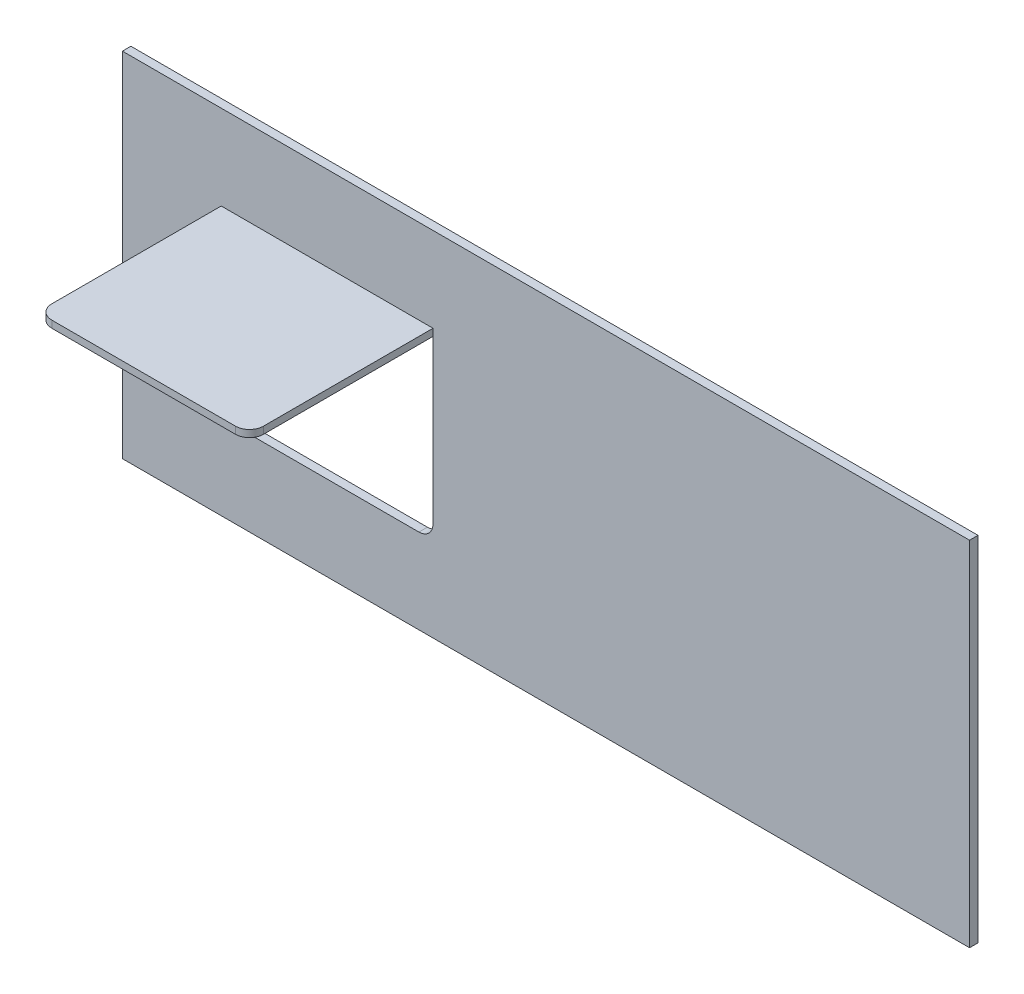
ISO-10303-21;
HEADER;
FILE_DESCRIPTION(('STEP AP214'),'2;1');
FILE_NAME('part.step','',(''),(''),'','','');
FILE_SCHEMA(('AUTOMOTIVE_DESIGN { 1 0 10303 214 1 1 1 1 }'));
ENDSEC;
DATA;
#1=APPLICATION_CONTEXT('core data for automotive mechanical design processes');
#2=APPLICATION_PROTOCOL_DEFINITION('international standard','automotive_design',2000,#1);
#3=PRODUCT_CONTEXT('',#1,'mechanical');
#4=PRODUCT('Part','Part','',(#3));
#5=PRODUCT_RELATED_PRODUCT_CATEGORY('part','',(#4));
#6=PRODUCT_DEFINITION_FORMATION('','',#4);
#7=PRODUCT_DEFINITION_CONTEXT('part definition',#1,'design');
#8=PRODUCT_DEFINITION('design','',#6,#7);
#9=PRODUCT_DEFINITION_SHAPE('','',#8);
#10=(LENGTH_UNIT() NAMED_UNIT(*) SI_UNIT(.MILLI.,.METRE.));
#11=(NAMED_UNIT(*) PLANE_ANGLE_UNIT() SI_UNIT($,.RADIAN.));
#12=(NAMED_UNIT(*) SI_UNIT($,.STERADIAN.) SOLID_ANGLE_UNIT());
#13=UNCERTAINTY_MEASURE_WITH_UNIT(LENGTH_MEASURE(1.E-05),#10,'distance_accuracy_value','');
#14=(GEOMETRIC_REPRESENTATION_CONTEXT(3) GLOBAL_UNCERTAINTY_ASSIGNED_CONTEXT((#13)) GLOBAL_UNIT_ASSIGNED_CONTEXT((#10,
#11,#12)) REPRESENTATION_CONTEXT('',''));
#15=CARTESIAN_POINT('',(0.,0.,0.));
#16=DIRECTION('',(0.,0.,1.));
#17=DIRECTION('',(1.,0.,0.));
#18=AXIS2_PLACEMENT_3D('',#15,#16,#17);
#19=CARTESIAN_POINT('',(70.,-65.,6.));
#20=DIRECTION('',(1.,0.,0.));
#21=DIRECTION('',(0.,0.,-1.));
#22=AXIS2_PLACEMENT_3D('',#19,#20,#21);
#23=PLANE('',#22);
#24=DIRECTION('',(0.,0.,-1.));
#25=VECTOR('',#24,1.);
#26=CARTESIAN_POINT('',(70.,-65.,6.));
#27=LINE('',#26,#25);
#28=CARTESIAN_POINT('',(70.,-65.,126.));
#29=VERTEX_POINT('',#28);
#30=CARTESIAN_POINT('',(70.,-65.,6.));
#31=VERTEX_POINT('',#30);
#32=EDGE_CURVE('E107',#29,#31,#27,.T.);
#33=ORIENTED_EDGE('',*,*,#32,.F.);
#34=DIRECTION('',(0.,1.,0.));
#35=VECTOR('',#34,1.);
#36=CARTESIAN_POINT('',(70.,-65.,126.));
#37=LINE('',#36,#35);
#38=CARTESIAN_POINT('',(70.,-60.,126.));
#39=VERTEX_POINT('',#38);
#40=EDGE_CURVE('E145',#29,#39,#37,.T.);
#41=ORIENTED_EDGE('',*,*,#40,.T.);
#42=DIRECTION('',(0.,0.,-1.));
#43=VECTOR('',#42,1.);
#44=CARTESIAN_POINT('',(70.,-60.,6.));
#45=LINE('',#44,#43);
#46=CARTESIAN_POINT('',(70.,-60.,6.));
#47=VERTEX_POINT('',#46);
#48=EDGE_CURVE('E129',#39,#47,#45,.T.);
#49=ORIENTED_EDGE('',*,*,#48,.T.);
#50=DIRECTION('',(0.,1.,0.));
#51=VECTOR('',#50,1.);
#52=CARTESIAN_POINT('',(70.,-65.,6.));
#53=LINE('',#52,#51);
#54=EDGE_CURVE('E123',#31,#47,#53,.T.);
#55=ORIENTED_EDGE('',*,*,#54,.F.);
#56=EDGE_LOOP('',(#33,#41,#49,#55));
#57=FACE_BOUND('',#56,.T.);
#58=ADVANCED_FACE('F55',(#57),#23,.F.);
#59=CARTESIAN_POINT('',(70.,-65.,6.));
#60=DIRECTION('',(0.,0.,1.));
#61=DIRECTION('',(1.,0.,0.));
#62=AXIS2_PLACEMENT_3D('',#59,#60,#61);
#63=PLANE('',#62);
#64=DIRECTION('',(1.,0.,0.));
#65=VECTOR('',#64,1.);
#66=CARTESIAN_POINT('',(70.,-60.,6.));
#67=LINE('',#66,#65);
#68=CARTESIAN_POINT('',(220.,-60.,6.));
#69=VERTEX_POINT('',#68);
#70=EDGE_CURVE('E150',#47,#69,#67,.T.);
#71=ORIENTED_EDGE('',*,*,#70,.T.);
#72=DIRECTION('',(0.,1.,0.));
#73=VECTOR('',#72,1.);
#74=CARTESIAN_POINT('',(220.,-65.,6.));
#75=LINE('',#74,#73);
#76=CARTESIAN_POINT('',(220.,-65.,6.));
#77=VERTEX_POINT('',#76);
#78=EDGE_CURVE('E125',#77,#69,#75,.T.);
#79=ORIENTED_EDGE('',*,*,#78,.F.);
#80=DIRECTION('',(1.,0.,0.));
#81=VECTOR('',#80,1.);
#82=CARTESIAN_POINT('',(70.,-65.,6.));
#83=LINE('',#82,#81);
#84=EDGE_CURVE('E111',#31,#77,#83,.T.);
#85=ORIENTED_EDGE('',*,*,#84,.F.);
#86=ORIENTED_EDGE('',*,*,#54,.T.);
#87=EDGE_LOOP('',(#71,#79,#85,#86));
#88=FACE_BOUND('',#87,.T.);
#89=ADVANCED_FACE('F122',(#88),#63,.F.);
#90=CARTESIAN_POINT('',(220.,-65.,6.));
#91=DIRECTION('',(-1.,0.,0.));
#92=DIRECTION('',(0.,0.,1.));
#93=AXIS2_PLACEMENT_3D('',#90,#91,#92);
#94=PLANE('',#93);
#95=DIRECTION('',(0.,0.,1.));
#96=VECTOR('',#95,1.);
#97=CARTESIAN_POINT('',(220.,-60.,6.));
#98=LINE('',#97,#96);
#99=CARTESIAN_POINT('',(220.,-60.,126.));
#100=VERTEX_POINT('',#99);
#101=EDGE_CURVE('E152',#69,#100,#98,.T.);
#102=ORIENTED_EDGE('',*,*,#101,.T.);
#103=DIRECTION('',(0.,1.,0.));
#104=VECTOR('',#103,1.);
#105=CARTESIAN_POINT('',(220.,-65.,126.));
#106=LINE('',#105,#104);
#107=CARTESIAN_POINT('',(220.,-65.,126.));
#108=VERTEX_POINT('',#107);
#109=EDGE_CURVE('E141',#100,#108,#106,.F.);
#110=ORIENTED_EDGE('',*,*,#109,.T.);
#111=DIRECTION('',(0.,0.,1.));
#112=VECTOR('',#111,1.);
#113=CARTESIAN_POINT('',(220.,-65.,6.));
#114=LINE('',#113,#112);
#115=EDGE_CURVE('E127',#77,#108,#114,.T.);
#116=ORIENTED_EDGE('',*,*,#115,.F.);
#117=ORIENTED_EDGE('',*,*,#78,.T.);
#118=EDGE_LOOP('',(#102,#110,#116,#117));
#119=FACE_BOUND('',#118,.T.);
#120=ADVANCED_FACE('F171',(#119),#94,.F.);
#121=CARTESIAN_POINT('',(70.,-65.,136.));
#122=DIRECTION('',(0.,0.,-1.));
#123=DIRECTION('',(-1.,0.,0.));
#124=AXIS2_PLACEMENT_3D('',#121,#122,#123);
#125=PLANE('',#124);
#126=DIRECTION('',(-1.,0.,0.));
#127=VECTOR('',#126,1.);
#128=CARTESIAN_POINT('',(70.,-60.,136.));
#129=LINE('',#128,#127);
#130=CARTESIAN_POINT('',(210.,-60.,136.));
#131=VERTEX_POINT('',#130);
#132=CARTESIAN_POINT('',(80.,-60.,136.));
#133=VERTEX_POINT('',#132);
#134=EDGE_CURVE('E118',#131,#133,#129,.T.);
#135=ORIENTED_EDGE('',*,*,#134,.T.);
#136=DIRECTION('',(0.,1.,0.));
#137=VECTOR('',#136,1.);
#138=CARTESIAN_POINT('',(80.,-65.,136.));
#139=LINE('',#138,#137);
#140=CARTESIAN_POINT('',(80.,-65.,136.));
#141=VERTEX_POINT('',#140);
#142=EDGE_CURVE('E63',#133,#141,#139,.F.);
#143=ORIENTED_EDGE('',*,*,#142,.T.);
#144=DIRECTION('',(-1.,0.,0.));
#145=VECTOR('',#144,1.);
#146=CARTESIAN_POINT('',(70.,-65.,136.));
#147=LINE('',#146,#145);
#148=CARTESIAN_POINT('',(210.,-65.,136.));
#149=VERTEX_POINT('',#148);
#150=EDGE_CURVE('E136',#149,#141,#147,.T.);
#151=ORIENTED_EDGE('',*,*,#150,.F.);
#152=DIRECTION('',(0.,1.,0.));
#153=VECTOR('',#152,1.);
#154=CARTESIAN_POINT('',(210.,-65.,136.));
#155=LINE('',#154,#153);
#156=EDGE_CURVE('E131',#149,#131,#155,.T.);
#157=ORIENTED_EDGE('',*,*,#156,.T.);
#158=EDGE_LOOP('',(#135,#143,#151,#157));
#159=FACE_BOUND('',#158,.T.);
#160=ADVANCED_FACE('F158',(#159),#125,.F.);
#161=CARTESIAN_POINT('',(0.,-65.,0.));
#162=DIRECTION('',(0.,1.,0.));
#163=DIRECTION('',(0.,0.,1.));
#164=AXIS2_PLACEMENT_3D('',#161,#162,#163);
#165=PLANE('',#164);
#166=ORIENTED_EDGE('',*,*,#150,.T.);
#167=CARTESIAN_POINT('',(80.,-65.,126.));
#168=DIRECTION('',(0.,1.,0.));
#169=DIRECTION('',(0.,0.,1.));
#170=AXIS2_PLACEMENT_3D('',#167,#168,#169);
#171=CIRCLE('',#170,10.);
#172=EDGE_CURVE('E12',#141,#29,#171,.F.);
#173=ORIENTED_EDGE('',*,*,#172,.T.);
#174=ORIENTED_EDGE('',*,*,#32,.T.);
#175=ORIENTED_EDGE('',*,*,#84,.T.);
#176=ORIENTED_EDGE('',*,*,#115,.T.);
#177=CARTESIAN_POINT('',(210.,-65.,126.));
#178=DIRECTION('',(0.,1.,0.));
#179=DIRECTION('',(0.,0.,1.));
#180=AXIS2_PLACEMENT_3D('',#177,#178,#179);
#181=CIRCLE('',#180,10.);
#182=EDGE_CURVE('E143',#108,#149,#181,.F.);
#183=ORIENTED_EDGE('',*,*,#182,.T.);
#184=EDGE_LOOP('',(#166,#173,#174,#175,#176,#183));
#185=FACE_BOUND('',#184,.T.);
#186=ADVANCED_FACE('F109',(#185),#165,.F.);
#187=CARTESIAN_POINT('',(0.,-60.,0.));
#188=DIRECTION('',(0.,1.,0.));
#189=DIRECTION('',(0.,0.,1.));
#190=AXIS2_PLACEMENT_3D('',#187,#188,#189);
#191=PLANE('',#190);
#192=ORIENTED_EDGE('',*,*,#48,.F.);
#193=CARTESIAN_POINT('',(80.,-60.,126.));
#194=DIRECTION('',(0.,1.,0.));
#195=DIRECTION('',(0.,0.,1.));
#196=AXIS2_PLACEMENT_3D('',#193,#194,#195);
#197=CIRCLE('',#196,10.);
#198=EDGE_CURVE('E77',#39,#133,#197,.T.);
#199=ORIENTED_EDGE('',*,*,#198,.T.);
#200=ORIENTED_EDGE('',*,*,#134,.F.);
#201=CARTESIAN_POINT('',(210.,-60.,126.));
#202=DIRECTION('',(0.,1.,0.));
#203=DIRECTION('',(0.,0.,1.));
#204=AXIS2_PLACEMENT_3D('',#201,#202,#203);
#205=CIRCLE('',#204,10.);
#206=EDGE_CURVE('E134',#131,#100,#205,.T.);
#207=ORIENTED_EDGE('',*,*,#206,.T.);
#208=ORIENTED_EDGE('',*,*,#101,.F.);
#209=ORIENTED_EDGE('',*,*,#70,.F.);
#210=EDGE_LOOP('',(#192,#199,#200,#207,#208,#209));
#211=FACE_BOUND('',#210,.T.);
#212=ADVANCED_FACE('F148',(#211),#191,.T.);
#213=CARTESIAN_POINT('',(210.,-65.,126.));
#214=DIRECTION('',(0.,1.,0.));
#215=DIRECTION('',(0.,0.,1.));
#216=AXIS2_PLACEMENT_3D('',#213,#214,#215);
#217=CYLINDRICAL_SURFACE('',#216,10.);
#218=ORIENTED_EDGE('',*,*,#182,.F.);
#219=ORIENTED_EDGE('',*,*,#109,.F.);
#220=ORIENTED_EDGE('',*,*,#206,.F.);
#221=ORIENTED_EDGE('',*,*,#156,.F.);
#222=EDGE_LOOP('',(#218,#219,#220,#221));
#223=FACE_BOUND('',#222,.T.);
#224=ADVANCED_FACE('F161',(#223),#217,.T.);
#225=CARTESIAN_POINT('',(80.,-65.,126.));
#226=DIRECTION('',(0.,1.,0.));
#227=DIRECTION('',(0.,0.,1.));
#228=AXIS2_PLACEMENT_3D('',#225,#226,#227);
#229=CYLINDRICAL_SURFACE('',#228,10.);
#230=ORIENTED_EDGE('',*,*,#172,.F.);
#231=ORIENTED_EDGE('',*,*,#142,.F.);
#232=ORIENTED_EDGE('',*,*,#198,.F.);
#233=ORIENTED_EDGE('',*,*,#40,.F.);
#234=EDGE_LOOP('',(#230,#231,#232,#233));
#235=FACE_BOUND('',#234,.T.);
#236=ADVANCED_FACE('F57',(#235),#229,.T.);
#237=CLOSED_SHELL('',(#58,#89,#120,#160,#186,#212,#224,#236));
#238=MANIFOLD_SOLID_BREP('B2',#237);
#239=CARTESIAN_POINT('',(1.11022302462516E-13,-250.,6.));
#240=DIRECTION('',(0.,1.,0.));
#241=DIRECTION('',(0.,0.,1.));
#242=AXIS2_PLACEMENT_3D('',#239,#240,#241);
#243=PLANE('',#242);
#244=DIRECTION('',(1.,0.,0.));
#245=VECTOR('',#244,1.);
#246=CARTESIAN_POINT('',(1.11022302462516E-13,-250.,0.));
#247=LINE('',#246,#245);
#248=CARTESIAN_POINT('',(1.11022302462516E-13,-250.,0.));
#249=VERTEX_POINT('',#248);
#250=CARTESIAN_POINT('',(600.,-250.,0.));
#251=VERTEX_POINT('',#250);
#252=EDGE_CURVE('E374',#249,#251,#247,.T.);
#253=ORIENTED_EDGE('',*,*,#252,.T.);
#254=DIRECTION('',(0.,0.,-1.));
#255=VECTOR('',#254,1.);
#256=CARTESIAN_POINT('',(600.,-250.,6.));
#257=LINE('',#256,#255);
#258=CARTESIAN_POINT('',(600.,-250.,6.));
#259=VERTEX_POINT('',#258);
#260=EDGE_CURVE('E414',#259,#251,#257,.T.);
#261=ORIENTED_EDGE('',*,*,#260,.F.);
#262=DIRECTION('',(1.,0.,0.));
#263=VECTOR('',#262,1.);
#264=CARTESIAN_POINT('',(1.11022302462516E-13,-250.,6.));
#265=LINE('',#264,#263);
#266=CARTESIAN_POINT('',(1.11022302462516E-13,-250.,6.));
#267=VERTEX_POINT('',#266);
#268=EDGE_CURVE('E376',#267,#259,#265,.T.);
#269=ORIENTED_EDGE('',*,*,#268,.F.);
#270=DIRECTION('',(0.,0.,-1.));
#271=VECTOR('',#270,1.);
#272=CARTESIAN_POINT('',(1.11022302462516E-13,-250.,6.));
#273=LINE('',#272,#271);
#274=EDGE_CURVE('E391',#267,#249,#273,.T.);
#275=ORIENTED_EDGE('',*,*,#274,.T.);
#276=EDGE_LOOP('',(#253,#261,#269,#275));
#277=FACE_BOUND('',#276,.T.);
#278=ADVANCED_FACE('F263',(#277),#243,.F.);
#279=CARTESIAN_POINT('',(600.,0.,6.));
#280=DIRECTION('',(1.,0.,0.));
#281=DIRECTION('',(0.,1.,0.));
#282=AXIS2_PLACEMENT_3D('',#279,#280,#281);
#283=PLANE('',#282);
#284=DIRECTION('',(0.,-1.,0.));
#285=VECTOR('',#284,1.);
#286=CARTESIAN_POINT('',(600.,0.,0.));
#287=LINE('',#286,#285);
#288=CARTESIAN_POINT('',(600.,0.,0.));
#289=VERTEX_POINT('',#288);
#290=EDGE_CURVE('E395',#289,#251,#287,.T.);
#291=ORIENTED_EDGE('',*,*,#290,.F.);
#292=DIRECTION('',(0.,0.,-1.));
#293=VECTOR('',#292,1.);
#294=CARTESIAN_POINT('',(600.,0.,6.));
#295=LINE('',#294,#293);
#296=CARTESIAN_POINT('',(600.,0.,6.));
#297=VERTEX_POINT('',#296);
#298=EDGE_CURVE('E411',#297,#289,#295,.T.);
#299=ORIENTED_EDGE('',*,*,#298,.F.);
#300=DIRECTION('',(0.,-1.,0.));
#301=VECTOR('',#300,1.);
#302=CARTESIAN_POINT('',(600.,0.,6.));
#303=LINE('',#302,#301);
#304=EDGE_CURVE('E379',#297,#259,#303,.T.);
#305=ORIENTED_EDGE('',*,*,#304,.T.);
#306=ORIENTED_EDGE('',*,*,#260,.T.);
#307=EDGE_LOOP('',(#291,#299,#305,#306));
#308=FACE_BOUND('',#307,.T.);
#309=ADVANCED_FACE('F466',(#308),#283,.T.);
#310=CARTESIAN_POINT('',(0.,0.,6.));
#311=DIRECTION('',(0.,1.,0.));
#312=DIRECTION('',(0.,0.,1.));
#313=AXIS2_PLACEMENT_3D('',#310,#311,#312);
#314=PLANE('',#313);
#315=DIRECTION('',(1.,0.,0.));
#316=VECTOR('',#315,1.);
#317=CARTESIAN_POINT('',(0.,0.,0.));
#318=LINE('',#317,#316);
#319=CARTESIAN_POINT('',(0.,0.,0.));
#320=VERTEX_POINT('',#319);
#321=EDGE_CURVE('E399',#320,#289,#318,.T.);
#322=ORIENTED_EDGE('',*,*,#321,.F.);
#323=DIRECTION('',(0.,0.,-1.));
#324=VECTOR('',#323,1.);
#325=CARTESIAN_POINT('',(0.,0.,6.));
#326=LINE('',#325,#324);
#327=CARTESIAN_POINT('',(0.,0.,6.));
#328=VERTEX_POINT('',#327);
#329=EDGE_CURVE('E408',#328,#320,#326,.T.);
#330=ORIENTED_EDGE('',*,*,#329,.F.);
#331=DIRECTION('',(1.,0.,0.));
#332=VECTOR('',#331,1.);
#333=CARTESIAN_POINT('',(0.,0.,6.));
#334=LINE('',#333,#332);
#335=EDGE_CURVE('E384',#328,#297,#334,.T.);
#336=ORIENTED_EDGE('',*,*,#335,.T.);
#337=ORIENTED_EDGE('',*,*,#298,.T.);
#338=EDGE_LOOP('',(#322,#330,#336,#337));
#339=FACE_BOUND('',#338,.T.);
#340=ADVANCED_FACE('F472',(#339),#314,.T.);
#341=CARTESIAN_POINT('',(0.,0.,6.));
#342=DIRECTION('',(1.,0.,0.));
#343=DIRECTION('',(0.,1.,0.));
#344=AXIS2_PLACEMENT_3D('',#341,#342,#343);
#345=PLANE('',#344);
#346=DIRECTION('',(0.,-1.,0.));
#347=VECTOR('',#346,1.);
#348=CARTESIAN_POINT('',(0.,0.,0.));
#349=LINE('',#348,#347);
#350=EDGE_CURVE('E380',#320,#249,#349,.T.);
#351=ORIENTED_EDGE('',*,*,#350,.T.);
#352=ORIENTED_EDGE('',*,*,#274,.F.);
#353=DIRECTION('',(0.,-1.,0.));
#354=VECTOR('',#353,1.);
#355=CARTESIAN_POINT('',(0.,0.,6.));
#356=LINE('',#355,#354);
#357=EDGE_CURVE('E388',#328,#267,#356,.T.);
#358=ORIENTED_EDGE('',*,*,#357,.F.);
#359=ORIENTED_EDGE('',*,*,#329,.T.);
#360=EDGE_LOOP('',(#351,#352,#358,#359));
#361=FACE_BOUND('',#360,.T.);
#362=ADVANCED_FACE('F478',(#361),#345,.F.);
#363=CARTESIAN_POINT('',(0.,0.,6.));
#364=DIRECTION('',(0.,0.,-1.));
#365=DIRECTION('',(-1.,0.,0.));
#366=AXIS2_PLACEMENT_3D('',#363,#364,#365);
#367=PLANE('',#366);
#368=DIRECTION('',(0.,-1.,0.));
#369=VECTOR('',#368,1.);
#370=CARTESIAN_POINT('',(220.,-60.,6.));
#371=LINE('',#370,#369);
#372=CARTESIAN_POINT('',(220.,-60.,6.));
#373=VERTEX_POINT('',#372);
#374=CARTESIAN_POINT('',(220.,-180.,6.));
#375=VERTEX_POINT('',#374);
#376=EDGE_CURVE('E357',#373,#375,#371,.T.);
#377=ORIENTED_EDGE('',*,*,#376,.T.);
#378=CARTESIAN_POINT('',(210.,-180.,6.00000000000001));
#379=DIRECTION('',(0.,0.,-1.));
#380=DIRECTION('',(-1.,0.,0.));
#381=AXIS2_PLACEMENT_3D('',#378,#379,#380);
#382=CIRCLE('',#381,10.);
#383=CARTESIAN_POINT('',(210.,-190.,6.));
#384=VERTEX_POINT('',#383);
#385=EDGE_CURVE('E272',#375,#384,#382,.T.);
#386=ORIENTED_EDGE('',*,*,#385,.T.);
#387=DIRECTION('',(1.,0.,0.));
#388=VECTOR('',#387,1.);
#389=CARTESIAN_POINT('',(70.,-190.,6.));
#390=LINE('',#389,#388);
#391=CARTESIAN_POINT('',(80.,-190.,6.));
#392=VERTEX_POINT('',#391);
#393=EDGE_CURVE('E362',#392,#384,#390,.T.);
#394=ORIENTED_EDGE('',*,*,#393,.F.);
#395=CARTESIAN_POINT('',(80.,-180.,6.00000000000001));
#396=DIRECTION('',(0.,0.,-1.));
#397=DIRECTION('',(-1.,0.,0.));
#398=AXIS2_PLACEMENT_3D('',#395,#396,#397);
#399=CIRCLE('',#398,10.);
#400=CARTESIAN_POINT('',(70.,-180.,6.));
#401=VERTEX_POINT('',#400);
#402=EDGE_CURVE('E435',#392,#401,#399,.T.);
#403=ORIENTED_EDGE('',*,*,#402,.T.);
#404=DIRECTION('',(0.,-1.,0.));
#405=VECTOR('',#404,1.);
#406=CARTESIAN_POINT('',(70.,-60.,6.));
#407=LINE('',#406,#405);
#408=CARTESIAN_POINT('',(70.,-60.,6.));
#409=VERTEX_POINT('',#408);
#410=EDGE_CURVE('E354',#409,#401,#407,.T.);
#411=ORIENTED_EDGE('',*,*,#410,.F.);
#412=DIRECTION('',(1.,0.,0.));
#413=VECTOR('',#412,1.);
#414=CARTESIAN_POINT('',(70.,-60.,6.));
#415=LINE('',#414,#413);
#416=EDGE_CURVE('E346',#409,#373,#415,.T.);
#417=ORIENTED_EDGE('',*,*,#416,.T.);
#418=EDGE_LOOP('',(#377,#386,#394,#403,#411,#417));
#419=FACE_BOUND('',#418,.T.);
#420=ORIENTED_EDGE('',*,*,#268,.T.);
#421=ORIENTED_EDGE('',*,*,#304,.F.);
#422=ORIENTED_EDGE('',*,*,#335,.F.);
#423=ORIENTED_EDGE('',*,*,#357,.T.);
#424=EDGE_LOOP('',(#420,#421,#422,#423));
#425=FACE_BOUND('',#424,.T.);
#426=ADVANCED_FACE('F364',(#419,#425),#367,.F.);
#427=CARTESIAN_POINT('',(0.,0.,0.));
#428=DIRECTION('',(0.,0.,-1.));
#429=DIRECTION('',(-1.,0.,0.));
#430=AXIS2_PLACEMENT_3D('',#427,#428,#429);
#431=PLANE('',#430);
#432=DIRECTION('',(-1.,0.,0.));
#433=VECTOR('',#432,1.);
#434=CARTESIAN_POINT('',(0.,-190.,0.));
#435=LINE('',#434,#433);
#436=CARTESIAN_POINT('',(210.,-190.,0.));
#437=VERTEX_POINT('',#436);
#438=CARTESIAN_POINT('',(80.,-190.,0.));
#439=VERTEX_POINT('',#438);
#440=EDGE_CURVE('E425',#437,#439,#435,.T.);
#441=ORIENTED_EDGE('',*,*,#440,.F.);
#442=CARTESIAN_POINT('',(210.,-180.,0.));
#443=DIRECTION('',(0.,0.,-1.));
#444=DIRECTION('',(-1.,0.,0.));
#445=AXIS2_PLACEMENT_3D('',#442,#443,#444);
#446=CIRCLE('',#445,10.);
#447=CARTESIAN_POINT('',(220.,-180.,0.));
#448=VERTEX_POINT('',#447);
#449=EDGE_CURVE('E53',#437,#448,#446,.F.);
#450=ORIENTED_EDGE('',*,*,#449,.T.);
#451=DIRECTION('',(0.,1.,0.));
#452=VECTOR('',#451,1.);
#453=CARTESIAN_POINT('',(220.,0.,0.));
#454=LINE('',#453,#452);
#455=CARTESIAN_POINT('',(220.,-60.,0.));
#456=VERTEX_POINT('',#455);
#457=EDGE_CURVE('E417',#448,#456,#454,.T.);
#458=ORIENTED_EDGE('',*,*,#457,.T.);
#459=DIRECTION('',(-1.,0.,0.));
#460=VECTOR('',#459,1.);
#461=CARTESIAN_POINT('',(0.,-60.,0.));
#462=LINE('',#461,#460);
#463=CARTESIAN_POINT('',(70.,-60.,0.));
#464=VERTEX_POINT('',#463);
#465=EDGE_CURVE('E349',#456,#464,#462,.T.);
#466=ORIENTED_EDGE('',*,*,#465,.T.);
#467=DIRECTION('',(0.,1.,0.));
#468=VECTOR('',#467,1.);
#469=CARTESIAN_POINT('',(70.,0.,0.));
#470=LINE('',#469,#468);
#471=CARTESIAN_POINT('',(70.,-180.,0.));
#472=VERTEX_POINT('',#471);
#473=EDGE_CURVE('E422',#472,#464,#470,.T.);
#474=ORIENTED_EDGE('',*,*,#473,.F.);
#475=CARTESIAN_POINT('',(80.,-180.,0.));
#476=DIRECTION('',(0.,0.,-1.));
#477=DIRECTION('',(-1.,0.,0.));
#478=AXIS2_PLACEMENT_3D('',#475,#476,#477);
#479=CIRCLE('',#478,10.);
#480=EDGE_CURVE('E438',#472,#439,#479,.F.);
#481=ORIENTED_EDGE('',*,*,#480,.T.);
#482=EDGE_LOOP('',(#441,#450,#458,#466,#474,#481));
#483=FACE_BOUND('',#482,.T.);
#484=ORIENTED_EDGE('',*,*,#252,.F.);
#485=ORIENTED_EDGE('',*,*,#350,.F.);
#486=ORIENTED_EDGE('',*,*,#321,.T.);
#487=ORIENTED_EDGE('',*,*,#290,.T.);
#488=EDGE_LOOP('',(#484,#485,#486,#487));
#489=FACE_BOUND('',#488,.T.);
#490=ADVANCED_FACE('F450',(#483,#489),#431,.T.);
#491=CARTESIAN_POINT('',(70.,-190.,-209.));
#492=DIRECTION('',(0.,-1.,0.));
#493=DIRECTION('',(0.,0.,-1.));
#494=AXIS2_PLACEMENT_3D('',#491,#492,#493);
#495=PLANE('',#494);
#496=ORIENTED_EDGE('',*,*,#393,.T.);
#497=DIRECTION('',(0.,0.,1.));
#498=VECTOR('',#497,1.);
#499=CARTESIAN_POINT('',(210.,-190.,-209.));
#500=LINE('',#499,#498);
#501=EDGE_CURVE('E285',#384,#437,#500,.F.);
#502=ORIENTED_EDGE('',*,*,#501,.T.);
#503=ORIENTED_EDGE('',*,*,#440,.T.);
#504=DIRECTION('',(0.,0.,1.));
#505=VECTOR('',#504,1.);
#506=CARTESIAN_POINT('',(80.,-190.,6.00000000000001));
#507=LINE('',#506,#505);
#508=EDGE_CURVE('E428',#439,#392,#507,.T.);
#509=ORIENTED_EDGE('',*,*,#508,.T.);
#510=EDGE_LOOP('',(#496,#502,#503,#509));
#511=FACE_BOUND('',#510,.T.);
#512=ADVANCED_FACE('F456',(#511),#495,.F.);
#513=CARTESIAN_POINT('',(70.,-60.,-209.));
#514=DIRECTION('',(-1.,0.,0.));
#515=DIRECTION('',(0.,0.,1.));
#516=AXIS2_PLACEMENT_3D('',#513,#514,#515);
#517=PLANE('',#516);
#518=ORIENTED_EDGE('',*,*,#410,.T.);
#519=DIRECTION('',(0.,0.,1.));
#520=VECTOR('',#519,1.);
#521=CARTESIAN_POINT('',(70.,-180.,0.));
#522=LINE('',#521,#520);
#523=EDGE_CURVE('E432',#401,#472,#522,.F.);
#524=ORIENTED_EDGE('',*,*,#523,.T.);
#525=ORIENTED_EDGE('',*,*,#473,.T.);
#526=DIRECTION('',(0.,0.,1.));
#527=VECTOR('',#526,1.);
#528=CARTESIAN_POINT('',(70.,-60.,-209.));
#529=LINE('',#528,#527);
#530=EDGE_CURVE('E353',#464,#409,#529,.T.);
#531=ORIENTED_EDGE('',*,*,#530,.T.);
#532=EDGE_LOOP('',(#518,#524,#525,#531));
#533=FACE_BOUND('',#532,.T.);
#534=ADVANCED_FACE('F459',(#533),#517,.F.);
#535=CARTESIAN_POINT('',(70.,-60.,-209.));
#536=DIRECTION('',(0.,-1.,0.));
#537=DIRECTION('',(0.,0.,-1.));
#538=AXIS2_PLACEMENT_3D('',#535,#536,#537);
#539=PLANE('',#538);
#540=DIRECTION('',(0.,0.,1.));
#541=VECTOR('',#540,1.);
#542=CARTESIAN_POINT('',(220.,-60.,-209.));
#543=LINE('',#542,#541);
#544=EDGE_CURVE('E341',#456,#373,#543,.T.);
#545=ORIENTED_EDGE('',*,*,#544,.T.);
#546=ORIENTED_EDGE('',*,*,#416,.F.);
#547=ORIENTED_EDGE('',*,*,#530,.F.);
#548=ORIENTED_EDGE('',*,*,#465,.F.);
#549=EDGE_LOOP('',(#545,#546,#547,#548));
#550=FACE_BOUND('',#549,.T.);
#551=ADVANCED_FACE('F343',(#550),#539,.T.);
#552=CARTESIAN_POINT('',(220.,-60.,-209.));
#553=DIRECTION('',(-1.,0.,0.));
#554=DIRECTION('',(0.,-1.,0.));
#555=AXIS2_PLACEMENT_3D('',#552,#553,#554);
#556=PLANE('',#555);
#557=ORIENTED_EDGE('',*,*,#457,.F.);
#558=DIRECTION('',(0.,0.,1.));
#559=VECTOR('',#558,1.);
#560=CARTESIAN_POINT('',(220.,-180.,-209.));
#561=LINE('',#560,#559);
#562=EDGE_CURVE('E360',#448,#375,#561,.T.);
#563=ORIENTED_EDGE('',*,*,#562,.T.);
#564=ORIENTED_EDGE('',*,*,#376,.F.);
#565=ORIENTED_EDGE('',*,*,#544,.F.);
#566=EDGE_LOOP('',(#557,#563,#564,#565));
#567=FACE_BOUND('',#566,.T.);
#568=ADVANCED_FACE('F358',(#567),#556,.T.);
#569=CARTESIAN_POINT('',(80.,-180.,-209.));
#570=DIRECTION('',(0.,0.,-1.));
#571=DIRECTION('',(-1.,0.,0.));
#572=AXIS2_PLACEMENT_3D('',#569,#570,#571);
#573=CYLINDRICAL_SURFACE('',#572,10.);
#574=ORIENTED_EDGE('',*,*,#480,.F.);
#575=ORIENTED_EDGE('',*,*,#523,.F.);
#576=ORIENTED_EDGE('',*,*,#402,.F.);
#577=ORIENTED_EDGE('',*,*,#508,.F.);
#578=EDGE_LOOP('',(#574,#575,#576,#577));
#579=FACE_BOUND('',#578,.T.);
#580=ADVANCED_FACE('F455',(#579),#573,.F.);
#581=CARTESIAN_POINT('',(210.,-180.,-209.));
#582=DIRECTION('',(0.,0.,1.));
#583=DIRECTION('',(1.,0.,0.));
#584=AXIS2_PLACEMENT_3D('',#581,#582,#583);
#585=CYLINDRICAL_SURFACE('',#584,10.);
#586=ORIENTED_EDGE('',*,*,#449,.F.);
#587=ORIENTED_EDGE('',*,*,#501,.F.);
#588=ORIENTED_EDGE('',*,*,#385,.F.);
#589=ORIENTED_EDGE('',*,*,#562,.F.);
#590=EDGE_LOOP('',(#586,#587,#588,#589));
#591=FACE_BOUND('',#590,.T.);
#592=ADVANCED_FACE('F265',(#591),#585,.F.);
#593=CLOSED_SHELL('',(#278,#309,#340,#362,#426,#490,#512,#534,#551,#568,#580,#592));
#594=MANIFOLD_SOLID_BREP('B6',#593);
#595=ADVANCED_BREP_SHAPE_REPRESENTATION('',(#18,#238,#594),#14);
#596=SHAPE_DEFINITION_REPRESENTATION(#9,#595);
ENDSEC;
END-ISO-10303-21;
